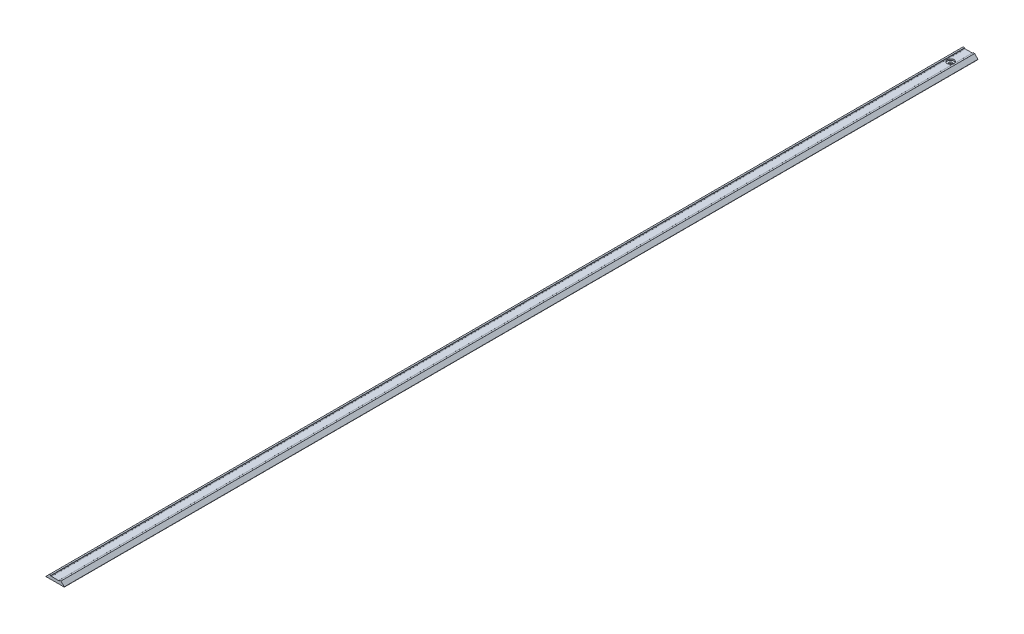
from build123d import *

# Parameters (mm, degrees)
EXTRUDE1_DEPTH                                      = 1000
CBORE_FOR_M3_HEX_SOCKET_HEAD_CAP_SCREW1_D           = 3.4
CBORE_FOR_M3_HEX_SOCKET_HEAD_CAP_SCREW1_CBORE_D     = 7.5
CBORE_FOR_M3_HEX_SOCKET_HEAD_CAP_SCREW1_CBORE_DEPTH = 1.5


with BuildPart() as part:
    # Sketch1 → Extrude1 (new body)
    with BuildSketch(Plane.XY):
        with BuildLine():
            Line((0.1, 0), (3, 0))
            Line((3, 0), (3, 0.05))
            Line((3, 0.05), (17, 0.05))
            Line((17, 0.05), (17, 0))
            Line((17, 0), (19.9, 0))
            ThreePointArc((19.9, 0), (19.970710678, 0.029289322), (20, 0.1))
            Line((20, 0.1), (20, 0.258578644))
            ThreePointArc((20, 0.258578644), (19.992387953, 0.296846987), (19.970710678, 0.329289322))
            Line((19.970710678, 0.329289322), (16.329289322, 3.970710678))
            ThreePointArc((16.329289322, 3.970710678), (16.296846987, 3.992387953), (16.258578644, 4))
            Line((16.258578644, 4), (14.65, 4))
            ThreePointArc((14.65, 4), (14.543933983, 3.956066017), (14.5, 3.85))
            Line((14.5, 3.85), (14.5, 3.75))
            ThreePointArc((14.5, 3.75), (14.543933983, 3.643933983), (14.65, 3.6))
            Line((14.65, 3.6), (14.975, 3.6))
            ThreePointArc((14.975, 3.6), (15.081066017, 3.556066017), (15.125, 3.45))
            Line((15.125, 3.45), (15.125, 3.4))
            ThreePointArc((15.125, 3.4), (15.081066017, 3.293933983), (14.975, 3.25))
            Line((14.975, 3.25), (14, 3.25))
            Line((14, 3.25), (14, 3.2))
            Line((14, 3.2), (9.9, 3.2))
            Line((9.9, 3.2), (6, 3.2))
            Line((6, 3.2), (6, 3.25))
            Line((6, 3.25), (5.025, 3.25))
            ThreePointArc((5.025, 3.25), (4.918933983, 3.293933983), (4.875, 3.4))
            Line((4.875, 3.4), (4.875, 3.45))
            ThreePointArc((4.875, 3.45), (4.918933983, 3.556066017), (5.025, 3.6))
            Line((5.025, 3.6), (5.35, 3.6))
            ThreePointArc((5.35, 3.6), (5.456066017, 3.643933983), (5.5, 3.75))
            Line((5.5, 3.75), (5.5, 3.85))
            ThreePointArc((5.5, 3.85), (5.456066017, 3.956066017), (5.35, 4))
            Line((5.35, 4), (3.741421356, 4))
            ThreePointArc((3.741421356, 4), (3.703153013, 3.992387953), (3.670710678, 3.970710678))
            Line((3.670710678, 3.970710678), (0.029289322, 0.329289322))
            ThreePointArc((0.029289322, 0.329289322), (0.007612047, 0.296846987), (0, 0.258578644))
            Line((0, 0.258578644), (0, 0.1))
            ThreePointArc((0, 0.1), (0.029289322, 0.029289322), (0.1, 0))
        make_face()
    extrude(amount=EXTRUDE1_DEPTH)

    # CBORE for M3 Hex Socket Head Cap Screw1 (through all)
    with Locations(Plane(origin=(0, 3.2, 0), x_dir=(-1, 0, 0), z_dir=(0, 1, 0))):
        with Locations((-10, 20)):
            CounterBoreHole(CBORE_FOR_M3_HEX_SOCKET_HEAD_CAP_SCREW1_D / 2, CBORE_FOR_M3_HEX_SOCKET_HEAD_CAP_SCREW1_CBORE_D / 2, CBORE_FOR_M3_HEX_SOCKET_HEAD_CAP_SCREW1_CBORE_DEPTH)


solid = part.part
